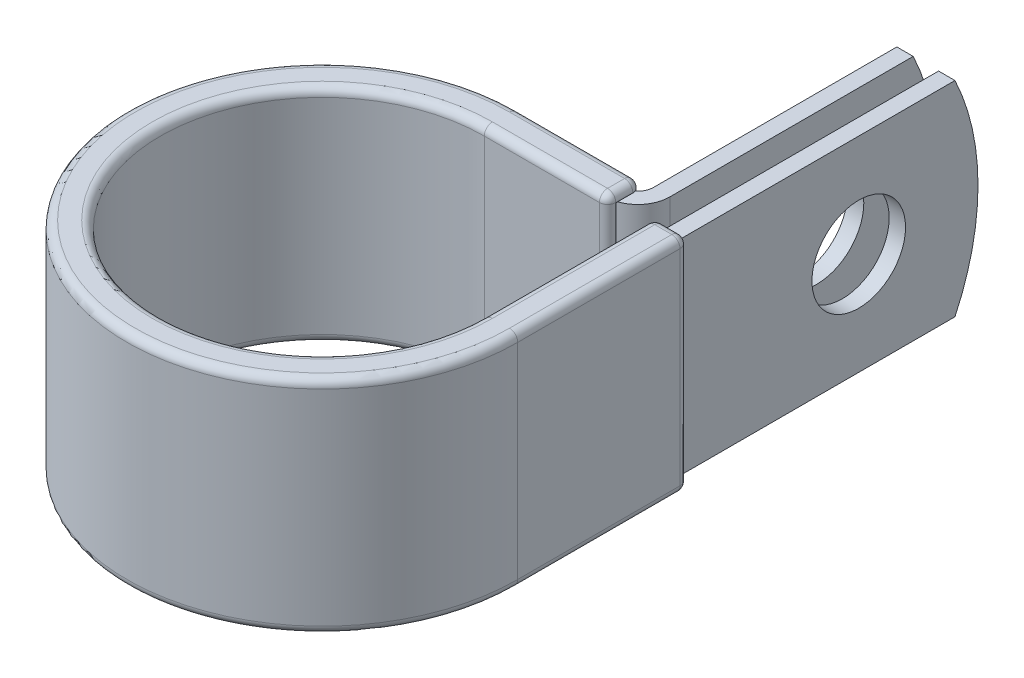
ISO-10303-21;
HEADER;
FILE_DESCRIPTION(('STEP AP214'),'2;1');
FILE_NAME('part.step','',(''),(''),'','','');
FILE_SCHEMA(('AUTOMOTIVE_DESIGN { 1 0 10303 214 1 1 1 1 }'));
ENDSEC;
DATA;
#1=APPLICATION_CONTEXT('core data for automotive mechanical design processes');
#2=APPLICATION_PROTOCOL_DEFINITION('international standard','automotive_design',2000,#1);
#3=PRODUCT_CONTEXT('',#1,'mechanical');
#4=PRODUCT('Part','Part','',(#3));
#5=PRODUCT_RELATED_PRODUCT_CATEGORY('part','',(#4));
#6=PRODUCT_DEFINITION_FORMATION('','',#4);
#7=PRODUCT_DEFINITION_CONTEXT('part definition',#1,'design');
#8=PRODUCT_DEFINITION('design','',#6,#7);
#9=PRODUCT_DEFINITION_SHAPE('','',#8);
#10=(LENGTH_UNIT() NAMED_UNIT(*) SI_UNIT(.MILLI.,.METRE.));
#11=(NAMED_UNIT(*) PLANE_ANGLE_UNIT() SI_UNIT($,.RADIAN.));
#12=(NAMED_UNIT(*) SI_UNIT($,.STERADIAN.) SOLID_ANGLE_UNIT());
#13=UNCERTAINTY_MEASURE_WITH_UNIT(LENGTH_MEASURE(1.E-05),#10,'distance_accuracy_value','');
#14=(GEOMETRIC_REPRESENTATION_CONTEXT(3) GLOBAL_UNCERTAINTY_ASSIGNED_CONTEXT((#13)) GLOBAL_UNIT_ASSIGNED_CONTEXT((#10,
#11,#12)) REPRESENTATION_CONTEXT('',''));
#15=CARTESIAN_POINT('',(0.,0.,0.));
#16=DIRECTION('',(0.,0.,1.));
#17=DIRECTION('',(1.,0.,0.));
#18=AXIS2_PLACEMENT_3D('',#15,#16,#17);
#19=CARTESIAN_POINT('',(13.50645,9.525,-43.6372));
#20=DIRECTION('',(1.,0.,0.));
#21=DIRECTION('',(0.,0.,-1.));
#22=AXIS2_PLACEMENT_3D('',#19,#20,#21);
#23=PLANE('',#22);
#24=CARTESIAN_POINT('',(13.50645,0.,-32.5374));
#25=DIRECTION('',(1.,0.,0.));
#26=DIRECTION('',(0.,0.,-1.));
#27=AXIS2_PLACEMENT_3D('',#24,#25,#26);
#28=CIRCLE('',#27,4.3561);
#29=CARTESIAN_POINT('',(13.50645,0.,-36.8935));
#30=VERTEX_POINT('',#29);
#31=EDGE_CURVE('E410',#30,#30,#28,.F.);
#32=ORIENTED_EDGE('',*,*,#31,.T.);
#33=EDGE_LOOP('',(#32));
#34=FACE_BOUND('',#33,.T.);
#35=DIRECTION('',(0.,0.,1.));
#36=VECTOR('',#35,1.);
#37=CARTESIAN_POINT('',(13.50645,-9.525,-43.6372));
#38=LINE('',#37,#36);
#39=CARTESIAN_POINT('',(13.50645,-9.525,-41.4926631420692));
#40=VERTEX_POINT('',#39);
#41=CARTESIAN_POINT('',(13.50645,-9.525,-18.84045));
#42=VERTEX_POINT('',#41);
#43=EDGE_CURVE('E432',#40,#42,#38,.T.);
#44=ORIENTED_EDGE('',*,*,#43,.F.);
#45=CARTESIAN_POINT('',(13.50645,0.,-21.4122));
#46=DIRECTION('',(1.,0.,0.));
#47=DIRECTION('',(0.,0.,-1.));
#48=AXIS2_PLACEMENT_3D('',#45,#46,#47);
#49=CIRCLE('',#48,22.225);
#50=CARTESIAN_POINT('',(13.50645,9.525,-41.4926631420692));
#51=VERTEX_POINT('',#50);
#52=EDGE_CURVE('E395',#40,#51,#49,.T.);
#53=ORIENTED_EDGE('',*,*,#52,.T.);
#54=DIRECTION('',(0.,0.,1.));
#55=VECTOR('',#54,1.);
#56=CARTESIAN_POINT('',(13.50645,9.525,-43.6372));
#57=LINE('',#56,#55);
#58=CARTESIAN_POINT('',(13.50645,9.525,-18.84045));
#59=VERTEX_POINT('',#58);
#60=EDGE_CURVE('E422',#51,#59,#57,.T.);
#61=ORIENTED_EDGE('',*,*,#60,.T.);
#62=DIRECTION('',(0.,-1.,0.));
#63=VECTOR('',#62,1.);
#64=CARTESIAN_POINT('',(13.50645,9.525,-18.84045));
#65=LINE('',#64,#63);
#66=EDGE_CURVE('E439',#59,#42,#65,.T.);
#67=ORIENTED_EDGE('',*,*,#66,.T.);
#68=EDGE_LOOP('',(#44,#53,#61,#67));
#69=FACE_BOUND('',#68,.T.);
#70=ADVANCED_FACE('F54',(#34,#69),#23,.T.);
#71=CARTESIAN_POINT('',(11.98245,9.525,-43.6372));
#72=DIRECTION('',(1.,0.,0.));
#73=DIRECTION('',(0.,0.,-1.));
#74=AXIS2_PLACEMENT_3D('',#71,#72,#73);
#75=PLANE('',#74);
#76=CARTESIAN_POINT('',(11.98245,0.,-32.5374));
#77=DIRECTION('',(-1.,0.,0.));
#78=DIRECTION('',(0.,0.,1.));
#79=AXIS2_PLACEMENT_3D('',#76,#77,#78);
#80=CIRCLE('',#79,4.3561);
#81=CARTESIAN_POINT('',(11.98245,0.,-28.1813));
#82=VERTEX_POINT('',#81);
#83=EDGE_CURVE('E407',#82,#82,#80,.T.);
#84=ORIENTED_EDGE('',*,*,#83,.F.);
#85=EDGE_LOOP('',(#84));
#86=FACE_BOUND('',#85,.T.);
#87=CARTESIAN_POINT('',(11.98245,0.,-21.4122));
#88=DIRECTION('',(-1.,0.,0.));
#89=DIRECTION('',(0.,0.,1.));
#90=AXIS2_PLACEMENT_3D('',#87,#88,#89);
#91=CIRCLE('',#90,22.225);
#92=CARTESIAN_POINT('',(11.98245,9.525,-41.4926631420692));
#93=VERTEX_POINT('',#92);
#94=CARTESIAN_POINT('',(11.98245,-9.525,-41.4926631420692));
#95=VERTEX_POINT('',#94);
#96=EDGE_CURVE('E387',#93,#95,#91,.T.);
#97=ORIENTED_EDGE('',*,*,#96,.T.);
#98=DIRECTION('',(0.,0.,1.));
#99=VECTOR('',#98,1.);
#100=CARTESIAN_POINT('',(11.98245,-9.525,-43.6372));
#101=LINE('',#100,#99);
#102=CARTESIAN_POINT('',(11.98245,-9.525,-18.84045));
#103=VERTEX_POINT('',#102);
#104=EDGE_CURVE('E434',#95,#103,#101,.T.);
#105=ORIENTED_EDGE('',*,*,#104,.T.);
#106=DIRECTION('',(0.,-1.,0.));
#107=VECTOR('',#106,1.);
#108=CARTESIAN_POINT('',(11.98245,9.525,-18.84045));
#109=LINE('',#108,#107);
#110=CARTESIAN_POINT('',(11.98245,9.525,-18.84045));
#111=VERTEX_POINT('',#110);
#112=EDGE_CURVE('E427',#111,#103,#109,.T.);
#113=ORIENTED_EDGE('',*,*,#112,.F.);
#114=DIRECTION('',(0.,0.,1.));
#115=VECTOR('',#114,1.);
#116=CARTESIAN_POINT('',(11.98245,9.525,-43.6372));
#117=LINE('',#116,#115);
#118=EDGE_CURVE('E424',#93,#111,#117,.T.);
#119=ORIENTED_EDGE('',*,*,#118,.F.);
#120=EDGE_LOOP('',(#97,#105,#113,#119));
#121=FACE_BOUND('',#120,.T.);
#122=ADVANCED_FACE('F738',(#86,#121),#75,.F.);
#123=CARTESIAN_POINT('',(0.,-9.525,0.));
#124=DIRECTION('',(0.,1.,0.));
#125=DIRECTION('',(1.,0.,0.));
#126=AXIS2_PLACEMENT_3D('',#123,#124,#125);
#127=PLANE('',#126);
#128=CARTESIAN_POINT('',(10.53465,-9.525,-18.84045));
#129=DIRECTION('',(0.,-1.,0.));
#130=DIRECTION('',(0.,0.,1.));
#131=AXIS2_PLACEMENT_3D('',#128,#129,#130);
#132=CIRCLE('',#131,2.9718);
#133=CARTESIAN_POINT('',(11.4744500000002,-9.525,-16.0211644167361));
#134=VERTEX_POINT('',#133);
#135=EDGE_CURVE('E429',#42,#134,#132,.T.);
#136=ORIENTED_EDGE('',*,*,#135,.T.);
#137=DIRECTION('',(0.,0.,-1.));
#138=VECTOR('',#137,1.);
#139=CARTESIAN_POINT('',(11.4744500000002,-9.525,-17.39265));
#140=LINE('',#139,#138);
#141=CARTESIAN_POINT('',(11.4744500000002,-9.525,-17.4244));
#142=VERTEX_POINT('',#141);
#143=EDGE_CURVE('E344',#134,#142,#140,.T.);
#144=ORIENTED_EDGE('',*,*,#143,.T.);
#145=CARTESIAN_POINT('',(10.7124500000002,-9.525,-17.4244));
#146=DIRECTION('',(0.,1.,0.));
#147=DIRECTION('',(0.,0.,1.));
#148=AXIS2_PLACEMENT_3D('',#145,#146,#147);
#149=CIRCLE('',#148,0.762);
#150=CARTESIAN_POINT('',(11.4237192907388,-9.525,-17.6977861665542));
#151=VERTEX_POINT('',#150);
#152=EDGE_CURVE('E504',#142,#151,#149,.T.);
#153=ORIENTED_EDGE('',*,*,#152,.T.);
#154=CARTESIAN_POINT('',(10.53465,-9.525,-18.84045));
#155=DIRECTION('',(0.,1.,0.));
#156=DIRECTION('',(1.,0.,0.));
#157=AXIS2_PLACEMENT_3D('',#154,#155,#156);
#158=CIRCLE('',#157,1.4478);
#159=EDGE_CURVE('E77',#103,#151,#158,.F.);
#160=ORIENTED_EDGE('',*,*,#159,.F.);
#161=ORIENTED_EDGE('',*,*,#104,.F.);
#162=DIRECTION('',(-1.,0.,0.));
#163=VECTOR('',#162,1.);
#164=CARTESIAN_POINT('',(17.39265,-9.525,-41.4926631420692));
#165=LINE('',#164,#163);
#166=EDGE_CURVE('E448',#40,#95,#165,.T.);
#167=ORIENTED_EDGE('',*,*,#166,.F.);
#168=ORIENTED_EDGE('',*,*,#43,.T.);
#169=EDGE_LOOP('',(#136,#144,#153,#160,#161,#167,#168));
#170=FACE_BOUND('',#169,.T.);
#171=ADVANCED_FACE('F744',(#170),#127,.F.);
#172=CARTESIAN_POINT('',(0.,9.525,0.));
#173=DIRECTION('',(0.,1.,0.));
#174=DIRECTION('',(1.,0.,0.));
#175=AXIS2_PLACEMENT_3D('',#172,#173,#174);
#176=PLANE('',#175);
#177=DIRECTION('',(0.,0.,-1.));
#178=VECTOR('',#177,1.);
#179=CARTESIAN_POINT('',(11.47445,9.525,1.60953919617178E-13));
#180=LINE('',#179,#178);
#181=CARTESIAN_POINT('',(11.4744500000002,9.525,-16.0211644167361));
#182=VERTEX_POINT('',#181);
#183=CARTESIAN_POINT('',(11.4744500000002,9.525,-17.4244));
#184=VERTEX_POINT('',#183);
#185=EDGE_CURVE('E381',#182,#184,#180,.T.);
#186=ORIENTED_EDGE('',*,*,#185,.F.);
#187=CARTESIAN_POINT('',(10.53465,9.525,-18.84045));
#188=DIRECTION('',(0.,-1.,0.));
#189=DIRECTION('',(0.,0.,1.));
#190=AXIS2_PLACEMENT_3D('',#187,#188,#189);
#191=CIRCLE('',#190,2.9718);
#192=EDGE_CURVE('E419',#59,#182,#191,.T.);
#193=ORIENTED_EDGE('',*,*,#192,.F.);
#194=ORIENTED_EDGE('',*,*,#60,.F.);
#195=DIRECTION('',(-1.,0.,0.));
#196=VECTOR('',#195,1.);
#197=CARTESIAN_POINT('',(17.39265,9.525,-41.4926631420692));
#198=LINE('',#197,#196);
#199=EDGE_CURVE('E445',#51,#93,#198,.T.);
#200=ORIENTED_EDGE('',*,*,#199,.T.);
#201=ORIENTED_EDGE('',*,*,#118,.T.);
#202=CARTESIAN_POINT('',(10.53465,9.525,-18.84045));
#203=DIRECTION('',(0.,1.,0.));
#204=DIRECTION('',(1.,0.,0.));
#205=AXIS2_PLACEMENT_3D('',#202,#203,#204);
#206=CIRCLE('',#205,1.4478);
#207=CARTESIAN_POINT('',(11.4237192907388,9.525,-17.6977861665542));
#208=VERTEX_POINT('',#207);
#209=EDGE_CURVE('E70',#111,#208,#206,.F.);
#210=ORIENTED_EDGE('',*,*,#209,.T.);
#211=CARTESIAN_POINT('',(10.7124500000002,9.525,-17.4244));
#212=DIRECTION('',(0.,1.,0.));
#213=DIRECTION('',(0.,0.,1.));
#214=AXIS2_PLACEMENT_3D('',#211,#212,#213);
#215=CIRCLE('',#214,0.762);
#216=EDGE_CURVE('E12',#208,#184,#215,.F.);
#217=ORIENTED_EDGE('',*,*,#216,.T.);
#218=EDGE_LOOP('',(#186,#193,#194,#200,#201,#210,#217));
#219=FACE_BOUND('',#218,.T.);
#220=ADVANCED_FACE('F752',(#219),#176,.T.);
#221=CARTESIAN_POINT('',(10.53465,9.525,-18.84045));
#222=DIRECTION('',(0.,-1.,0.));
#223=DIRECTION('',(0.,0.,-1.));
#224=AXIS2_PLACEMENT_3D('',#221,#222,#223);
#225=CYLINDRICAL_SURFACE('',#224,2.9718);
#226=ORIENTED_EDGE('',*,*,#135,.F.);
#227=ORIENTED_EDGE('',*,*,#66,.F.);
#228=ORIENTED_EDGE('',*,*,#192,.T.);
#229=CARTESIAN_POINT('',(10.53465,9.525,-18.84045));
#230=DIRECTION('',(0.,-1.,0.));
#231=DIRECTION('',(0.,0.,-1.));
#232=AXIS2_PLACEMENT_3D('',#229,#230,#231);
#233=CIRCLE('',#232,2.9718);
#234=CARTESIAN_POINT('',(10.53465,9.525,-15.86865));
#235=VERTEX_POINT('',#234);
#236=EDGE_CURVE('E378',#235,#182,#233,.F.);
#237=ORIENTED_EDGE('',*,*,#236,.F.);
#238=DIRECTION('',(0.,-1.,0.));
#239=VECTOR('',#238,1.);
#240=CARTESIAN_POINT('',(10.53465,9.525,-15.86865));
#241=LINE('',#240,#239);
#242=CARTESIAN_POINT('',(10.53465,-9.525,-15.86865));
#243=VERTEX_POINT('',#242);
#244=EDGE_CURVE('E442',#235,#243,#241,.T.);
#245=ORIENTED_EDGE('',*,*,#244,.T.);
#246=CARTESIAN_POINT('',(10.53465,-9.525,-18.84045));
#247=DIRECTION('',(0.,1.,0.));
#248=DIRECTION('',(0.,0.,1.));
#249=AXIS2_PLACEMENT_3D('',#246,#247,#248);
#250=CIRCLE('',#249,2.9718);
#251=EDGE_CURVE('E376',#134,#243,#250,.F.);
#252=ORIENTED_EDGE('',*,*,#251,.F.);
#253=EDGE_LOOP('',(#226,#227,#228,#237,#245,#252));
#254=FACE_BOUND('',#253,.T.);
#255=ADVANCED_FACE('F749',(#254),#225,.T.);
#256=CARTESIAN_POINT('',(10.53465,9.525,-18.84045));
#257=DIRECTION('',(0.,-1.,0.));
#258=DIRECTION('',(0.,0.,-1.));
#259=AXIS2_PLACEMENT_3D('',#256,#257,#258);
#260=CYLINDRICAL_SURFACE('',#259,1.4478);
#261=ORIENTED_EDGE('',*,*,#159,.T.);
#262=DIRECTION('',(0.,1.,0.));
#263=VECTOR('',#262,1.);
#264=CARTESIAN_POINT('',(11.423719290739,-9.525,-17.697786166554));
#265=LINE('',#264,#263);
#266=EDGE_CURVE('E63',#151,#208,#265,.T.);
#267=ORIENTED_EDGE('',*,*,#266,.T.);
#268=ORIENTED_EDGE('',*,*,#209,.F.);
#269=ORIENTED_EDGE('',*,*,#112,.T.);
#270=EDGE_LOOP('',(#261,#267,#268,#269));
#271=FACE_BOUND('',#270,.T.);
#272=ADVANCED_FACE('F751',(#271),#260,.F.);
#273=CARTESIAN_POINT('',(25.8273613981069,0.,-32.5374));
#274=DIRECTION('',(-1.,0.,0.));
#275=DIRECTION('',(0.,0.,1.));
#276=AXIS2_PLACEMENT_3D('',#273,#274,#275);
#277=CYLINDRICAL_SURFACE('',#276,4.3561);
#278=ORIENTED_EDGE('',*,*,#83,.T.);
#279=EDGE_LOOP('',(#278));
#280=FACE_BOUND('',#279,.T.);
#281=ORIENTED_EDGE('',*,*,#31,.F.);
#282=EDGE_LOOP('',(#281));
#283=FACE_BOUND('',#282,.T.);
#284=ADVANCED_FACE('F758',(#280,#283),#277,.F.);
#285=CARTESIAN_POINT('',(17.39265,0.,-21.4122));
#286=DIRECTION('',(-1.,0.,0.));
#287=DIRECTION('',(0.,0.,1.));
#288=AXIS2_PLACEMENT_3D('',#285,#286,#287);
#289=CYLINDRICAL_SURFACE('',#288,22.225);
#290=ORIENTED_EDGE('',*,*,#52,.F.);
#291=ORIENTED_EDGE('',*,*,#166,.T.);
#292=ORIENTED_EDGE('',*,*,#96,.F.);
#293=ORIENTED_EDGE('',*,*,#199,.F.);
#294=EDGE_LOOP('',(#290,#291,#292,#293));
#295=FACE_BOUND('',#294,.T.);
#296=ADVANCED_FACE('F809',(#295),#289,.T.);
#297=CARTESIAN_POINT('',(2.29530949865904E-13,-9.525,-15.86865));
#298=DIRECTION('',(0.,0.,1.));
#299=DIRECTION('',(1.,0.,0.));
#300=AXIS2_PLACEMENT_3D('',#297,#298,#299);
#301=PLANE('',#300);
#302=DIRECTION('',(1.,0.,0.));
#303=VECTOR('',#302,1.);
#304=CARTESIAN_POINT('',(2.29530949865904E-13,-9.525,-15.86865));
#305=LINE('',#304,#303);
#306=CARTESIAN_POINT('',(11.4744500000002,-9.525,-15.86865));
#307=VERTEX_POINT('',#306);
#308=EDGE_CURVE('E351',#243,#307,#305,.T.);
#309=ORIENTED_EDGE('',*,*,#308,.F.);
#310=ORIENTED_EDGE('',*,*,#244,.F.);
#311=DIRECTION('',(1.,0.,0.));
#312=VECTOR('',#311,1.);
#313=CARTESIAN_POINT('',(2.29530949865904E-13,9.525,-15.86865));
#314=LINE('',#313,#312);
#315=CARTESIAN_POINT('',(11.4744500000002,9.525,-15.86865));
#316=VERTEX_POINT('',#315);
#317=EDGE_CURVE('E353',#235,#316,#314,.T.);
#318=ORIENTED_EDGE('',*,*,#317,.T.);
#319=DIRECTION('',(0.,-1.,0.));
#320=VECTOR('',#319,1.);
#321=CARTESIAN_POINT('',(11.4744500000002,-9.525,-15.86865));
#322=LINE('',#321,#320);
#323=EDGE_CURVE('E283',#316,#307,#322,.T.);
#324=ORIENTED_EDGE('',*,*,#323,.T.);
#325=EDGE_LOOP('',(#309,#310,#318,#324));
#326=FACE_BOUND('',#325,.T.);
#327=ADVANCED_FACE('F781',(#326),#301,.F.);
#328=CARTESIAN_POINT('',(11.4744500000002,-9.55675,-15.8369));
#329=DIRECTION('',(1.,0.,0.));
#330=DIRECTION('',(0.,0.,-1.));
#331=AXIS2_PLACEMENT_3D('',#328,#329,#330);
#332=PLANE('',#331);
#333=DIRECTION('',(0.,0.,-1.));
#334=VECTOR('',#333,1.);
#335=CARTESIAN_POINT('',(11.4744500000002,-9.55675,-17.4244));
#336=LINE('',#335,#334);
#337=CARTESIAN_POINT('',(11.4744500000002,-9.55675,-15.8369));
#338=VERTEX_POINT('',#337);
#339=CARTESIAN_POINT('',(11.4744500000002,-9.55675,-17.4244));
#340=VERTEX_POINT('',#339);
#341=EDGE_CURVE('E458',#338,#340,#336,.T.);
#342=ORIENTED_EDGE('',*,*,#341,.T.);
#343=DIRECTION('',(0.,1.,0.));
#344=VECTOR('',#343,1.);
#345=CARTESIAN_POINT('',(11.4744500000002,-9.55675,-17.4244));
#346=LINE('',#345,#344);
#347=EDGE_CURVE('E462',#340,#142,#346,.T.);
#348=ORIENTED_EDGE('',*,*,#347,.T.);
#349=ORIENTED_EDGE('',*,*,#143,.F.);
#350=EDGE_CURVE('E345',#307,#134,#140,.T.);
#351=ORIENTED_EDGE('',*,*,#350,.F.);
#352=ORIENTED_EDGE('',*,*,#323,.F.);
#353=DIRECTION('',(0.,0.,1.));
#354=VECTOR('',#353,1.);
#355=CARTESIAN_POINT('',(11.4744500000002,9.525,-15.86865));
#356=LINE('',#355,#354);
#357=EDGE_CURVE('E348',#182,#316,#356,.T.);
#358=ORIENTED_EDGE('',*,*,#357,.F.);
#359=ORIENTED_EDGE('',*,*,#185,.T.);
#360=DIRECTION('',(0.,1.,0.));
#361=VECTOR('',#360,1.);
#362=CARTESIAN_POINT('',(11.4744500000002,-9.55675,-17.4244));
#363=LINE('',#362,#361);
#364=CARTESIAN_POINT('',(11.4744500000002,9.55674999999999,-17.4244));
#365=VERTEX_POINT('',#364);
#366=EDGE_CURVE('E460',#184,#365,#363,.T.);
#367=ORIENTED_EDGE('',*,*,#366,.T.);
#368=DIRECTION('',(0.,0.,1.));
#369=VECTOR('',#368,1.);
#370=CARTESIAN_POINT('',(11.4744500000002,9.55674999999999,-15.8369));
#371=LINE('',#370,#369);
#372=CARTESIAN_POINT('',(11.4744500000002,9.55674999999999,-15.8369));
#373=VERTEX_POINT('',#372);
#374=EDGE_CURVE('E454',#365,#373,#371,.T.);
#375=ORIENTED_EDGE('',*,*,#374,.T.);
#376=DIRECTION('',(0.,-1.,0.));
#377=VECTOR('',#376,1.);
#378=CARTESIAN_POINT('',(11.4744500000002,-9.55675,-15.8369));
#379=LINE('',#378,#377);
#380=EDGE_CURVE('E456',#373,#338,#379,.T.);
#381=ORIENTED_EDGE('',*,*,#380,.T.);
#382=EDGE_LOOP('',(#342,#348,#349,#351,#352,#358,#359,#367,#375,#381));
#383=FACE_BOUND('',#382,.T.);
#384=ADVANCED_FACE('F777',(#383),#332,.T.);
#385=CARTESIAN_POINT('',(2.51353700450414E-13,-9.55675,-17.4244));
#386=DIRECTION('',(1.,0.,0.));
#387=DIRECTION('',(0.,0.,-1.));
#388=AXIS2_PLACEMENT_3D('',#385,#386,#387);
#389=CYLINDRICAL_SURFACE('',#388,0.762000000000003);
#390=DIRECTION('',(1.,0.,0.));
#391=VECTOR('',#390,1.);
#392=CARTESIAN_POINT('',(2.62042394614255E-13,-9.55675,-18.1864));
#393=LINE('',#392,#391);
#394=CARTESIAN_POINT('',(2.62042394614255E-13,-9.55675,-18.1864));
#395=VERTEX_POINT('',#394);
#396=CARTESIAN_POINT('',(10.7124500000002,-9.55675,-18.1864));
#397=VERTEX_POINT('',#396);
#398=EDGE_CURVE('E370',#395,#397,#393,.T.);
#399=ORIENTED_EDGE('',*,*,#398,.T.);
#400=CARTESIAN_POINT('',(10.7124500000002,-9.55675,-17.4244));
#401=DIRECTION('',(1.,0.,0.));
#402=DIRECTION('',(0.,0.,-1.));
#403=AXIS2_PLACEMENT_3D('',#400,#401,#402);
#404=CIRCLE('',#403,0.762000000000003);
#405=CARTESIAN_POINT('',(10.7124500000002,-10.31875,-17.4244));
#406=VERTEX_POINT('',#405);
#407=EDGE_CURVE('E467',#397,#406,#404,.F.);
#408=ORIENTED_EDGE('',*,*,#407,.T.);
#409=DIRECTION('',(1.,0.,0.));
#410=VECTOR('',#409,1.);
#411=CARTESIAN_POINT('',(2.51353700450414E-13,-10.31875,-17.4244));
#412=LINE('',#411,#410);
#413=CARTESIAN_POINT('',(2.51353700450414E-13,-10.31875,-17.4244));
#414=VERTEX_POINT('',#413);
#415=EDGE_CURVE('E373',#414,#406,#412,.T.);
#416=ORIENTED_EDGE('',*,*,#415,.F.);
#417=CARTESIAN_POINT('',(2.51353700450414E-13,-9.55675,-17.4244));
#418=DIRECTION('',(1.,0.,0.));
#419=DIRECTION('',(0.,0.,1.));
#420=AXIS2_PLACEMENT_3D('',#417,#418,#419);
#421=CIRCLE('',#420,0.762000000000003);
#422=EDGE_CURVE('E321',#414,#395,#421,.T.);
#423=ORIENTED_EDGE('',*,*,#422,.T.);
#424=EDGE_LOOP('',(#399,#408,#416,#423));
#425=FACE_BOUND('',#424,.T.);
#426=ADVANCED_FACE('F620',(#425),#389,.T.);
#427=CARTESIAN_POINT('',(2.62042394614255E-13,9.55675,-18.1864));
#428=DIRECTION('',(0.,0.,-1.));
#429=DIRECTION('',(0.,1.,0.));
#430=AXIS2_PLACEMENT_3D('',#427,#428,#429);
#431=PLANE('',#430);
#432=DIRECTION('',(1.,0.,0.));
#433=VECTOR('',#432,1.);
#434=CARTESIAN_POINT('',(2.62042394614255E-13,9.55675,-18.1864));
#435=LINE('',#434,#433);
#436=CARTESIAN_POINT('',(2.62042394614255E-13,9.55675,-18.1864));
#437=VERTEX_POINT('',#436);
#438=CARTESIAN_POINT('',(10.7124500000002,9.55675,-18.1864));
#439=VERTEX_POINT('',#438);
#440=EDGE_CURVE('E367',#437,#439,#435,.T.);
#441=ORIENTED_EDGE('',*,*,#440,.T.);
#442=DIRECTION('',(0.,1.,0.));
#443=VECTOR('',#442,1.);
#444=CARTESIAN_POINT('',(10.7124500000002,9.55675,-18.1864));
#445=LINE('',#444,#443);
#446=EDGE_CURVE('E465',#439,#397,#445,.F.);
#447=ORIENTED_EDGE('',*,*,#446,.T.);
#448=ORIENTED_EDGE('',*,*,#398,.F.);
#449=DIRECTION('',(0.,1.,0.));
#450=VECTOR('',#449,1.);
#451=CARTESIAN_POINT('',(2.62042394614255E-13,9.55675,-18.1864));
#452=LINE('',#451,#450);
#453=EDGE_CURVE('E318',#395,#437,#452,.T.);
#454=ORIENTED_EDGE('',*,*,#453,.T.);
#455=EDGE_LOOP('',(#441,#447,#448,#454));
#456=FACE_BOUND('',#455,.T.);
#457=ADVANCED_FACE('F626',(#456),#431,.T.);
#458=CARTESIAN_POINT('',(2.51353700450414E-13,9.55675,-17.4244));
#459=DIRECTION('',(1.,0.,0.));
#460=DIRECTION('',(0.,0.,-1.));
#461=AXIS2_PLACEMENT_3D('',#458,#459,#460);
#462=CYLINDRICAL_SURFACE('',#461,0.762000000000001);
#463=DIRECTION('',(1.,0.,0.));
#464=VECTOR('',#463,1.);
#465=CARTESIAN_POINT('',(2.51353700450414E-13,10.31875,-17.4244));
#466=LINE('',#465,#464);
#467=CARTESIAN_POINT('',(2.51353700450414E-13,10.31875,-17.4244));
#468=VERTEX_POINT('',#467);
#469=CARTESIAN_POINT('',(10.7124500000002,10.31875,-17.4244));
#470=VERTEX_POINT('',#469);
#471=EDGE_CURVE('E364',#468,#470,#466,.T.);
#472=ORIENTED_EDGE('',*,*,#471,.T.);
#473=CARTESIAN_POINT('',(10.7124500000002,9.55675,-17.4244));
#474=DIRECTION('',(1.,0.,0.));
#475=DIRECTION('',(0.,0.,-1.));
#476=AXIS2_PLACEMENT_3D('',#473,#474,#475);
#477=CIRCLE('',#476,0.762000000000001);
#478=EDGE_CURVE('E451',#470,#439,#477,.F.);
#479=ORIENTED_EDGE('',*,*,#478,.T.);
#480=ORIENTED_EDGE('',*,*,#440,.F.);
#481=CARTESIAN_POINT('',(2.51353700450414E-13,9.55675,-17.4244));
#482=DIRECTION('',(1.,0.,0.));
#483=DIRECTION('',(0.,0.,1.));
#484=AXIS2_PLACEMENT_3D('',#481,#482,#483);
#485=CIRCLE('',#484,0.762000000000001);
#486=EDGE_CURVE('E315',#437,#468,#485,.T.);
#487=ORIENTED_EDGE('',*,*,#486,.T.);
#488=EDGE_LOOP('',(#472,#479,#480,#487));
#489=FACE_BOUND('',#488,.T.);
#490=ADVANCED_FACE('F630',(#489),#462,.T.);
#491=CARTESIAN_POINT('',(2.29085587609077E-13,9.55675,-15.8369));
#492=DIRECTION('',(1.,0.,0.));
#493=DIRECTION('',(0.,0.,-1.));
#494=AXIS2_PLACEMENT_3D('',#491,#492,#493);
#495=CYLINDRICAL_SURFACE('',#494,0.762000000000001);
#496=DIRECTION('',(1.,0.,0.));
#497=VECTOR('',#496,1.);
#498=CARTESIAN_POINT('',(2.18396893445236E-13,9.55675,-15.0749));
#499=LINE('',#498,#497);
#500=CARTESIAN_POINT('',(2.18396893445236E-13,9.55675,-15.0749));
#501=VERTEX_POINT('',#500);
#502=CARTESIAN_POINT('',(10.7124500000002,9.55675,-15.0749));
#503=VERTEX_POINT('',#502);
#504=EDGE_CURVE('E358',#501,#503,#499,.T.);
#505=ORIENTED_EDGE('',*,*,#504,.T.);
#506=CARTESIAN_POINT('',(10.7124500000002,9.55675,-15.8369));
#507=DIRECTION('',(1.,0.,0.));
#508=DIRECTION('',(0.,0.,-1.));
#509=AXIS2_PLACEMENT_3D('',#506,#507,#508);
#510=CIRCLE('',#509,0.762000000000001);
#511=CARTESIAN_POINT('',(10.7124500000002,10.31875,-15.8369));
#512=VERTEX_POINT('',#511);
#513=EDGE_CURVE('E477',#503,#512,#510,.F.);
#514=ORIENTED_EDGE('',*,*,#513,.T.);
#515=DIRECTION('',(1.,0.,0.));
#516=VECTOR('',#515,1.);
#517=CARTESIAN_POINT('',(2.29085587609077E-13,10.31875,-15.8369));
#518=LINE('',#517,#516);
#519=CARTESIAN_POINT('',(2.29085587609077E-13,10.31875,-15.8369));
#520=VERTEX_POINT('',#519);
#521=EDGE_CURVE('E361',#520,#512,#518,.T.);
#522=ORIENTED_EDGE('',*,*,#521,.F.);
#523=CARTESIAN_POINT('',(2.29085587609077E-13,9.55675,-15.8369));
#524=DIRECTION('',(1.,0.,0.));
#525=DIRECTION('',(0.,0.,1.));
#526=AXIS2_PLACEMENT_3D('',#523,#524,#525);
#527=CIRCLE('',#526,0.762000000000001);
#528=EDGE_CURVE('E312',#520,#501,#527,.T.);
#529=ORIENTED_EDGE('',*,*,#528,.T.);
#530=EDGE_LOOP('',(#505,#514,#522,#529));
#531=FACE_BOUND('',#530,.T.);
#532=ADVANCED_FACE('F671',(#531),#495,.T.);
#533=CARTESIAN_POINT('',(2.18396893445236E-13,-9.55675,-15.0749));
#534=DIRECTION('',(0.,0.,1.));
#535=DIRECTION('',(1.,0.,0.));
#536=AXIS2_PLACEMENT_3D('',#533,#534,#535);
#537=PLANE('',#536);
#538=DIRECTION('',(1.,0.,0.));
#539=VECTOR('',#538,1.);
#540=CARTESIAN_POINT('',(2.18396893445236E-13,-9.55675,-15.0749));
#541=LINE('',#540,#539);
#542=CARTESIAN_POINT('',(2.18396893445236E-13,-9.55675,-15.0749));
#543=VERTEX_POINT('',#542);
#544=CARTESIAN_POINT('',(10.7124500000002,-9.55675,-15.0749));
#545=VERTEX_POINT('',#544);
#546=EDGE_CURVE('E355',#543,#545,#541,.T.);
#547=ORIENTED_EDGE('',*,*,#546,.T.);
#548=DIRECTION('',(0.,-1.,0.));
#549=VECTOR('',#548,1.);
#550=CARTESIAN_POINT('',(10.7124500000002,-9.55675,-15.0749));
#551=LINE('',#550,#549);
#552=EDGE_CURVE('E475',#545,#503,#551,.F.);
#553=ORIENTED_EDGE('',*,*,#552,.T.);
#554=ORIENTED_EDGE('',*,*,#504,.F.);
#555=DIRECTION('',(0.,-1.,0.));
#556=VECTOR('',#555,1.);
#557=CARTESIAN_POINT('',(2.18396893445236E-13,-9.55675,-15.0749));
#558=LINE('',#557,#556);
#559=EDGE_CURVE('E303',#501,#543,#558,.T.);
#560=ORIENTED_EDGE('',*,*,#559,.T.);
#561=EDGE_LOOP('',(#547,#553,#554,#560));
#562=FACE_BOUND('',#561,.T.);
#563=ADVANCED_FACE('F669',(#562),#537,.T.);
#564=CARTESIAN_POINT('',(2.29085587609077E-13,-9.55675,-15.8369));
#565=DIRECTION('',(1.,0.,0.));
#566=DIRECTION('',(0.,0.,-1.));
#567=AXIS2_PLACEMENT_3D('',#564,#565,#566);
#568=CYLINDRICAL_SURFACE('',#567,0.762);
#569=DIRECTION('',(1.,0.,0.));
#570=VECTOR('',#569,1.);
#571=CARTESIAN_POINT('',(2.29085587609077E-13,-10.31875,-15.8369));
#572=LINE('',#571,#570);
#573=CARTESIAN_POINT('',(2.29085587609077E-13,-10.31875,-15.8369));
#574=VERTEX_POINT('',#573);
#575=CARTESIAN_POINT('',(10.7124500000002,-10.31875,-15.8369));
#576=VERTEX_POINT('',#575);
#577=EDGE_CURVE('E279',#574,#576,#572,.T.);
#578=ORIENTED_EDGE('',*,*,#577,.T.);
#579=CARTESIAN_POINT('',(10.7124500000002,-9.55675,-15.8369));
#580=DIRECTION('',(1.,0.,0.));
#581=DIRECTION('',(0.,0.,-1.));
#582=AXIS2_PLACEMENT_3D('',#579,#580,#581);
#583=CIRCLE('',#582,0.762);
#584=EDGE_CURVE('E473',#576,#545,#583,.F.);
#585=ORIENTED_EDGE('',*,*,#584,.T.);
#586=ORIENTED_EDGE('',*,*,#546,.F.);
#587=CARTESIAN_POINT('',(2.29085587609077E-13,-9.55675,-15.8369));
#588=DIRECTION('',(1.,0.,0.));
#589=DIRECTION('',(0.,0.,-1.));
#590=AXIS2_PLACEMENT_3D('',#587,#588,#589);
#591=CIRCLE('',#590,0.762);
#592=EDGE_CURVE('E300',#543,#574,#591,.T.);
#593=ORIENTED_EDGE('',*,*,#592,.T.);
#594=EDGE_LOOP('',(#578,#585,#586,#593));
#595=FACE_BOUND('',#594,.T.);
#596=ADVANCED_FACE('F659',(#595),#568,.T.);
#597=CARTESIAN_POINT('',(0.,-9.55675,0.));
#598=DIRECTION('',(0.,-1.,0.));
#599=DIRECTION('',(0.,0.,-1.));
#600=AXIS2_PLACEMENT_3D('',#597,#598,#599);
#601=TOROIDAL_SURFACE('',#600,17.4244,0.762000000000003);
#602=CARTESIAN_POINT('',(17.4244,-9.55675,0.));
#603=DIRECTION('',(0.,0.,1.));
#604=DIRECTION('',(-1.,0.,0.));
#605=AXIS2_PLACEMENT_3D('',#602,#603,#604);
#606=CIRCLE('',#605,0.762000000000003);
#607=CARTESIAN_POINT('',(17.4244,-10.31875,0.));
#608=VERTEX_POINT('',#607);
#609=CARTESIAN_POINT('',(18.1864,-9.55675,0.));
#610=VERTEX_POINT('',#609);
#611=EDGE_CURVE('E294',#608,#610,#606,.T.);
#612=ORIENTED_EDGE('',*,*,#611,.T.);
#613=CARTESIAN_POINT('',(0.,-9.55675,0.));
#614=DIRECTION('',(0.,-1.,0.));
#615=DIRECTION('',(0.,0.,-1.));
#616=AXIS2_PLACEMENT_3D('',#613,#614,#615);
#617=CIRCLE('',#616,18.1864);
#618=EDGE_CURVE('E337',#610,#395,#617,.T.);
#619=ORIENTED_EDGE('',*,*,#618,.T.);
#620=ORIENTED_EDGE('',*,*,#422,.F.);
#621=CARTESIAN_POINT('',(0.,-10.31875,0.));
#622=DIRECTION('',(0.,-1.,0.));
#623=DIRECTION('',(0.,0.,-1.));
#624=AXIS2_PLACEMENT_3D('',#621,#622,#623);
#625=CIRCLE('',#624,17.4244);
#626=EDGE_CURVE('E284',#608,#414,#625,.T.);
#627=ORIENTED_EDGE('',*,*,#626,.F.);
#628=EDGE_LOOP('',(#612,#619,#620,#627));
#629=FACE_BOUND('',#628,.T.);
#630=ADVANCED_FACE('F617',(#629),#601,.T.);
#631=CARTESIAN_POINT('',(0.,9.525,0.));
#632=DIRECTION('',(0.,-1.,0.));
#633=DIRECTION('',(0.,0.,-1.));
#634=AXIS2_PLACEMENT_3D('',#631,#632,#633);
#635=CYLINDRICAL_SURFACE('',#634,18.1864);
#636=DIRECTION('',(0.,1.,0.));
#637=VECTOR('',#636,1.);
#638=CARTESIAN_POINT('',(18.1864,9.55675,0.));
#639=LINE('',#638,#637);
#640=CARTESIAN_POINT('',(18.1864,9.55675,0.));
#641=VERTEX_POINT('',#640);
#642=EDGE_CURVE('E605',#610,#641,#639,.T.);
#643=ORIENTED_EDGE('',*,*,#642,.T.);
#644=CARTESIAN_POINT('',(0.,9.55675,0.));
#645=DIRECTION('',(0.,-1.,0.));
#646=DIRECTION('',(0.,0.,-1.));
#647=AXIS2_PLACEMENT_3D('',#644,#645,#646);
#648=CIRCLE('',#647,18.1864);
#649=EDGE_CURVE('E334',#641,#437,#648,.T.);
#650=ORIENTED_EDGE('',*,*,#649,.T.);
#651=ORIENTED_EDGE('',*,*,#453,.F.);
#652=ORIENTED_EDGE('',*,*,#618,.F.);
#653=EDGE_LOOP('',(#643,#650,#651,#652));
#654=FACE_BOUND('',#653,.T.);
#655=ADVANCED_FACE('F623',(#654),#635,.T.);
#656=CARTESIAN_POINT('',(0.,9.55675,0.));
#657=DIRECTION('',(0.,-1.,0.));
#658=DIRECTION('',(0.,0.,-1.));
#659=AXIS2_PLACEMENT_3D('',#656,#657,#658);
#660=TOROIDAL_SURFACE('',#659,17.4244,0.762000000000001);
#661=CARTESIAN_POINT('',(17.4244,9.55675,0.));
#662=DIRECTION('',(0.,0.,1.));
#663=DIRECTION('',(-1.,0.,0.));
#664=AXIS2_PLACEMENT_3D('',#661,#662,#663);
#665=CIRCLE('',#664,0.762000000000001);
#666=CARTESIAN_POINT('',(17.4244,10.31875,0.));
#667=VERTEX_POINT('',#666);
#668=EDGE_CURVE('E684',#641,#667,#665,.T.);
#669=ORIENTED_EDGE('',*,*,#668,.T.);
#670=CARTESIAN_POINT('',(0.,10.31875,0.));
#671=DIRECTION('',(0.,-1.,0.));
#672=DIRECTION('',(0.,0.,-1.));
#673=AXIS2_PLACEMENT_3D('',#670,#671,#672);
#674=CIRCLE('',#673,17.4244);
#675=EDGE_CURVE('E331',#667,#468,#674,.T.);
#676=ORIENTED_EDGE('',*,*,#675,.T.);
#677=ORIENTED_EDGE('',*,*,#486,.F.);
#678=ORIENTED_EDGE('',*,*,#649,.F.);
#679=EDGE_LOOP('',(#669,#676,#677,#678));
#680=FACE_BOUND('',#679,.T.);
#681=ADVANCED_FACE('F628',(#680),#660,.T.);
#682=CARTESIAN_POINT('',(0.,9.55675,0.));
#683=DIRECTION('',(0.,-1.,0.));
#684=DIRECTION('',(0.,0.,-1.));
#685=AXIS2_PLACEMENT_3D('',#682,#683,#684);
#686=TOROIDAL_SURFACE('',#685,15.8369,0.762000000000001);
#687=CARTESIAN_POINT('',(15.8369,9.55675,0.));
#688=DIRECTION('',(0.,0.,1.));
#689=DIRECTION('',(-1.,0.,0.));
#690=AXIS2_PLACEMENT_3D('',#687,#688,#689);
#691=CIRCLE('',#690,0.762000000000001);
#692=CARTESIAN_POINT('',(15.8369,10.31875,0.));
#693=VERTEX_POINT('',#692);
#694=CARTESIAN_POINT('',(15.0749,9.55675,0.));
#695=VERTEX_POINT('',#694);
#696=EDGE_CURVE('E680',#693,#695,#691,.T.);
#697=ORIENTED_EDGE('',*,*,#696,.T.);
#698=CARTESIAN_POINT('',(0.,9.55675,0.));
#699=DIRECTION('',(0.,-1.,0.));
#700=DIRECTION('',(0.,0.,-1.));
#701=AXIS2_PLACEMENT_3D('',#698,#699,#700);
#702=CIRCLE('',#701,15.0749);
#703=EDGE_CURVE('E325',#695,#501,#702,.T.);
#704=ORIENTED_EDGE('',*,*,#703,.T.);
#705=ORIENTED_EDGE('',*,*,#528,.F.);
#706=CARTESIAN_POINT('',(0.,10.31875,0.));
#707=DIRECTION('',(0.,-1.,0.));
#708=DIRECTION('',(0.,0.,-1.));
#709=AXIS2_PLACEMENT_3D('',#706,#707,#708);
#710=CIRCLE('',#709,15.8369);
#711=EDGE_CURVE('E328',#693,#520,#710,.T.);
#712=ORIENTED_EDGE('',*,*,#711,.F.);
#713=EDGE_LOOP('',(#697,#704,#705,#712));
#714=FACE_BOUND('',#713,.T.);
#715=ADVANCED_FACE('F678',(#714),#686,.T.);
#716=CARTESIAN_POINT('',(0.,9.525,0.));
#717=DIRECTION('',(0.,-1.,0.));
#718=DIRECTION('',(0.,0.,-1.));
#719=AXIS2_PLACEMENT_3D('',#716,#717,#718);
#720=CYLINDRICAL_SURFACE('',#719,15.0749);
#721=DIRECTION('',(0.,-1.,0.));
#722=VECTOR('',#721,1.);
#723=CARTESIAN_POINT('',(15.0749,-9.55675,0.));
#724=LINE('',#723,#722);
#725=CARTESIAN_POINT('',(15.0749,-9.55675,0.));
#726=VERTEX_POINT('',#725);
#727=EDGE_CURVE('E683',#695,#726,#724,.T.);
#728=ORIENTED_EDGE('',*,*,#727,.T.);
#729=CARTESIAN_POINT('',(0.,-9.55675,0.));
#730=DIRECTION('',(0.,-1.,0.));
#731=DIRECTION('',(0.,0.,-1.));
#732=AXIS2_PLACEMENT_3D('',#729,#730,#731);
#733=CIRCLE('',#732,15.0749);
#734=EDGE_CURVE('E290',#726,#543,#733,.T.);
#735=ORIENTED_EDGE('',*,*,#734,.T.);
#736=ORIENTED_EDGE('',*,*,#559,.F.);
#737=ORIENTED_EDGE('',*,*,#703,.F.);
#738=EDGE_LOOP('',(#728,#735,#736,#737));
#739=FACE_BOUND('',#738,.T.);
#740=ADVANCED_FACE('F676',(#739),#720,.F.);
#741=CARTESIAN_POINT('',(0.,-9.55675,0.));
#742=DIRECTION('',(0.,-1.,0.));
#743=DIRECTION('',(0.,0.,-1.));
#744=AXIS2_PLACEMENT_3D('',#741,#742,#743);
#745=TOROIDAL_SURFACE('',#744,15.8369,0.762);
#746=CARTESIAN_POINT('',(15.8369,-9.55675,0.));
#747=DIRECTION('',(0.,0.,1.));
#748=DIRECTION('',(1.,0.,0.));
#749=AXIS2_PLACEMENT_3D('',#746,#747,#748);
#750=CIRCLE('',#749,0.762);
#751=CARTESIAN_POINT('',(15.8369,-10.31875,0.));
#752=VERTEX_POINT('',#751);
#753=EDGE_CURVE('E287',#726,#752,#750,.T.);
#754=ORIENTED_EDGE('',*,*,#753,.T.);
#755=CARTESIAN_POINT('',(0.,-10.31875,0.));
#756=DIRECTION('',(0.,-1.,0.));
#757=DIRECTION('',(0.,0.,-1.));
#758=AXIS2_PLACEMENT_3D('',#755,#756,#757);
#759=CIRCLE('',#758,15.8369);
#760=EDGE_CURVE('E271',#752,#574,#759,.T.);
#761=ORIENTED_EDGE('',*,*,#760,.T.);
#762=ORIENTED_EDGE('',*,*,#592,.F.);
#763=ORIENTED_EDGE('',*,*,#734,.F.);
#764=EDGE_LOOP('',(#754,#761,#762,#763));
#765=FACE_BOUND('',#764,.T.);
#766=ADVANCED_FACE('F288',(#765),#745,.T.);
#767=CARTESIAN_POINT('',(15.8369,-9.55675,0.));
#768=DIRECTION('',(0.,0.,-1.));
#769=DIRECTION('',(-1.,0.,0.));
#770=AXIS2_PLACEMENT_3D('',#767,#768,#769);
#771=CYLINDRICAL_SURFACE('',#770,0.762);
#772=DIRECTION('',(0.,0.,-1.));
#773=VECTOR('',#772,1.);
#774=CARTESIAN_POINT('',(15.0749,-9.55675,0.));
#775=LINE('',#774,#773);
#776=CARTESIAN_POINT('',(15.0749,-9.55675,-15.10665));
#777=VERTEX_POINT('',#776);
#778=EDGE_CURVE('E691',#726,#777,#775,.T.);
#779=ORIENTED_EDGE('',*,*,#778,.T.);
#780=CARTESIAN_POINT('',(15.8369,-9.55675,-15.10665));
#781=DIRECTION('',(0.,0.,-1.));
#782=DIRECTION('',(-1.,0.,0.));
#783=AXIS2_PLACEMENT_3D('',#780,#781,#782);
#784=CIRCLE('',#783,0.762);
#785=CARTESIAN_POINT('',(15.8369,-10.31875,-15.10665));
#786=VERTEX_POINT('',#785);
#787=EDGE_CURVE('E299',#777,#786,#784,.F.);
#788=ORIENTED_EDGE('',*,*,#787,.T.);
#789=DIRECTION('',(0.,0.,-1.));
#790=VECTOR('',#789,1.);
#791=CARTESIAN_POINT('',(15.8369,-10.31875,0.));
#792=LINE('',#791,#790);
#793=EDGE_CURVE('E276',#752,#786,#792,.T.);
#794=ORIENTED_EDGE('',*,*,#793,.F.);
#795=ORIENTED_EDGE('',*,*,#753,.F.);
#796=EDGE_LOOP('',(#779,#788,#794,#795));
#797=FACE_BOUND('',#796,.T.);
#798=ADVANCED_FACE('F297',(#797),#771,.T.);
#799=CARTESIAN_POINT('',(17.4244,-10.31875,0.));
#800=DIRECTION('',(0.,1.,0.));
#801=DIRECTION('',(0.,0.,1.));
#802=AXIS2_PLACEMENT_3D('',#799,#800,#801);
#803=PLANE('',#802);
#804=ORIENTED_EDGE('',*,*,#415,.T.);
#805=DIRECTION('',(0.,0.,-1.));
#806=VECTOR('',#805,1.);
#807=CARTESIAN_POINT('',(10.7124500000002,-10.31875,-15.8369));
#808=LINE('',#807,#806);
#809=EDGE_CURVE('E471',#406,#576,#808,.F.);
#810=ORIENTED_EDGE('',*,*,#809,.T.);
#811=ORIENTED_EDGE('',*,*,#577,.F.);
#812=ORIENTED_EDGE('',*,*,#760,.F.);
#813=ORIENTED_EDGE('',*,*,#793,.T.);
#814=DIRECTION('',(1.,0.,0.));
#815=VECTOR('',#814,1.);
#816=CARTESIAN_POINT('',(17.4244,-10.31875,-15.10665));
#817=LINE('',#816,#815);
#818=CARTESIAN_POINT('',(17.4244,-10.31875,-15.10665));
#819=VERTEX_POINT('',#818);
#820=EDGE_CURVE('E469',#786,#819,#817,.T.);
#821=ORIENTED_EDGE('',*,*,#820,.T.);
#822=DIRECTION('',(0.,0.,-1.));
#823=VECTOR('',#822,1.);
#824=CARTESIAN_POINT('',(17.4244,-10.31875,0.));
#825=LINE('',#824,#823);
#826=EDGE_CURVE('E301',#608,#819,#825,.T.);
#827=ORIENTED_EDGE('',*,*,#826,.F.);
#828=ORIENTED_EDGE('',*,*,#626,.T.);
#829=EDGE_LOOP('',(#804,#810,#811,#812,#813,#821,#827,#828));
#830=FACE_BOUND('',#829,.T.);
#831=ADVANCED_FACE('F274',(#830),#803,.F.);
#832=CARTESIAN_POINT('',(17.4244,-9.55675,0.));
#833=DIRECTION('',(0.,0.,-1.));
#834=DIRECTION('',(-1.,0.,0.));
#835=AXIS2_PLACEMENT_3D('',#832,#833,#834);
#836=CYLINDRICAL_SURFACE('',#835,0.762000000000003);
#837=ORIENTED_EDGE('',*,*,#826,.T.);
#838=CARTESIAN_POINT('',(17.4244,-9.55675,-15.10665));
#839=DIRECTION('',(0.,0.,-1.));
#840=DIRECTION('',(-1.,0.,0.));
#841=AXIS2_PLACEMENT_3D('',#838,#839,#840);
#842=CIRCLE('',#841,0.762000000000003);
#843=CARTESIAN_POINT('',(18.1864,-9.55675,-15.10665));
#844=VERTEX_POINT('',#843);
#845=EDGE_CURVE('E493',#819,#844,#842,.F.);
#846=ORIENTED_EDGE('',*,*,#845,.T.);
#847=DIRECTION('',(0.,0.,-1.));
#848=VECTOR('',#847,1.);
#849=CARTESIAN_POINT('',(18.1864,-9.55675,0.));
#850=LINE('',#849,#848);
#851=EDGE_CURVE('E306',#610,#844,#850,.T.);
#852=ORIENTED_EDGE('',*,*,#851,.F.);
#853=ORIENTED_EDGE('',*,*,#611,.F.);
#854=EDGE_LOOP('',(#837,#846,#852,#853));
#855=FACE_BOUND('',#854,.T.);
#856=ADVANCED_FACE('F611',(#855),#836,.T.);
#857=CARTESIAN_POINT('',(18.1864,9.55675,0.));
#858=DIRECTION('',(-1.,0.,0.));
#859=DIRECTION('',(0.,-1.,0.));
#860=AXIS2_PLACEMENT_3D('',#857,#858,#859);
#861=PLANE('',#860);
#862=ORIENTED_EDGE('',*,*,#851,.T.);
#863=DIRECTION('',(0.,1.,0.));
#864=VECTOR('',#863,1.);
#865=CARTESIAN_POINT('',(18.1864,9.55675,-15.10665));
#866=LINE('',#865,#864);
#867=CARTESIAN_POINT('',(18.1864,9.55675,-15.10665));
#868=VERTEX_POINT('',#867);
#869=EDGE_CURVE('E482',#844,#868,#866,.T.);
#870=ORIENTED_EDGE('',*,*,#869,.T.);
#871=DIRECTION('',(0.,0.,-1.));
#872=VECTOR('',#871,1.);
#873=CARTESIAN_POINT('',(18.1864,9.55675,0.));
#874=LINE('',#873,#872);
#875=EDGE_CURVE('E590',#641,#868,#874,.T.);
#876=ORIENTED_EDGE('',*,*,#875,.F.);
#877=ORIENTED_EDGE('',*,*,#642,.F.);
#878=EDGE_LOOP('',(#862,#870,#876,#877));
#879=FACE_BOUND('',#878,.T.);
#880=ADVANCED_FACE('F603',(#879),#861,.F.);
#881=CARTESIAN_POINT('',(17.4244,9.55675,0.));
#882=DIRECTION('',(0.,0.,-1.));
#883=DIRECTION('',(-1.,0.,0.));
#884=AXIS2_PLACEMENT_3D('',#881,#882,#883);
#885=CYLINDRICAL_SURFACE('',#884,0.762000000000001);
#886=ORIENTED_EDGE('',*,*,#875,.T.);
#887=CARTESIAN_POINT('',(17.4244,9.55675,-15.10665));
#888=DIRECTION('',(0.,0.,-1.));
#889=DIRECTION('',(-1.,0.,0.));
#890=AXIS2_PLACEMENT_3D('',#887,#888,#889);
#891=CIRCLE('',#890,0.762000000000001);
#892=CARTESIAN_POINT('',(17.4244,10.31875,-15.10665));
#893=VERTEX_POINT('',#892);
#894=EDGE_CURVE('E479',#868,#893,#891,.F.);
#895=ORIENTED_EDGE('',*,*,#894,.T.);
#896=DIRECTION('',(0.,0.,-1.));
#897=VECTOR('',#896,1.);
#898=CARTESIAN_POINT('',(17.4244,10.31875,0.));
#899=LINE('',#898,#897);
#900=EDGE_CURVE('E588',#667,#893,#899,.T.);
#901=ORIENTED_EDGE('',*,*,#900,.F.);
#902=ORIENTED_EDGE('',*,*,#668,.F.);
#903=EDGE_LOOP('',(#886,#895,#901,#902));
#904=FACE_BOUND('',#903,.T.);
#905=ADVANCED_FACE('F586',(#904),#885,.T.);
#906=CARTESIAN_POINT('',(15.8369,10.31875,0.));
#907=DIRECTION('',(0.,-1.,0.));
#908=DIRECTION('',(1.,0.,0.));
#909=AXIS2_PLACEMENT_3D('',#906,#907,#908);
#910=PLANE('',#909);
#911=ORIENTED_EDGE('',*,*,#521,.T.);
#912=DIRECTION('',(0.,0.,1.));
#913=VECTOR('',#912,1.);
#914=CARTESIAN_POINT('',(10.7124500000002,10.31875,-17.4244));
#915=LINE('',#914,#913);
#916=EDGE_CURVE('E502',#512,#470,#915,.F.);
#917=ORIENTED_EDGE('',*,*,#916,.T.);
#918=ORIENTED_EDGE('',*,*,#471,.F.);
#919=ORIENTED_EDGE('',*,*,#675,.F.);
#920=ORIENTED_EDGE('',*,*,#900,.T.);
#921=DIRECTION('',(-1.,0.,0.));
#922=VECTOR('',#921,1.);
#923=CARTESIAN_POINT('',(15.8369,10.31875,-15.10665));
#924=LINE('',#923,#922);
#925=CARTESIAN_POINT('',(15.8369,10.31875,-15.10665));
#926=VERTEX_POINT('',#925);
#927=EDGE_CURVE('E500',#893,#926,#924,.T.);
#928=ORIENTED_EDGE('',*,*,#927,.T.);
#929=DIRECTION('',(0.,0.,-1.));
#930=VECTOR('',#929,1.);
#931=CARTESIAN_POINT('',(15.8369,10.31875,0.));
#932=LINE('',#931,#930);
#933=EDGE_CURVE('E593',#693,#926,#932,.T.);
#934=ORIENTED_EDGE('',*,*,#933,.F.);
#935=ORIENTED_EDGE('',*,*,#711,.T.);
#936=EDGE_LOOP('',(#911,#917,#918,#919,#920,#928,#934,#935));
#937=FACE_BOUND('',#936,.T.);
#938=ADVANCED_FACE('F591',(#937),#910,.F.);
#939=CARTESIAN_POINT('',(15.8369,9.55675,0.));
#940=DIRECTION('',(0.,0.,-1.));
#941=DIRECTION('',(-1.,0.,0.));
#942=AXIS2_PLACEMENT_3D('',#939,#940,#941);
#943=CYLINDRICAL_SURFACE('',#942,0.762000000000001);
#944=ORIENTED_EDGE('',*,*,#933,.T.);
#945=CARTESIAN_POINT('',(15.8369,9.55675,-15.10665));
#946=DIRECTION('',(0.,0.,-1.));
#947=DIRECTION('',(-1.,0.,0.));
#948=AXIS2_PLACEMENT_3D('',#945,#946,#947);
#949=CIRCLE('',#948,0.762000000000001);
#950=CARTESIAN_POINT('',(15.0749,9.55675,-15.10665));
#951=VERTEX_POINT('',#950);
#952=EDGE_CURVE('E498',#926,#951,#949,.F.);
#953=ORIENTED_EDGE('',*,*,#952,.T.);
#954=DIRECTION('',(0.,0.,-1.));
#955=VECTOR('',#954,1.);
#956=CARTESIAN_POINT('',(15.0749,9.55675,0.));
#957=LINE('',#956,#955);
#958=EDGE_CURVE('E596',#695,#951,#957,.T.);
#959=ORIENTED_EDGE('',*,*,#958,.F.);
#960=ORIENTED_EDGE('',*,*,#696,.F.);
#961=EDGE_LOOP('',(#944,#953,#959,#960));
#962=FACE_BOUND('',#961,.T.);
#963=ADVANCED_FACE('F688',(#962),#943,.T.);
#964=CARTESIAN_POINT('',(15.86865,9.525,0.));
#965=DIRECTION('',(0.,-1.,0.));
#966=DIRECTION('',(0.,0.,-1.));
#967=AXIS2_PLACEMENT_3D('',#964,#965,#966);
#968=PLANE('',#967);
#969=ORIENTED_EDGE('',*,*,#317,.F.);
#970=ORIENTED_EDGE('',*,*,#236,.T.);
#971=ORIENTED_EDGE('',*,*,#357,.T.);
#972=EDGE_LOOP('',(#969,#970,#971));
#973=FACE_BOUND('',#972,.T.);
#974=ADVANCED_FACE('F775',(#973),#968,.T.);
#975=CARTESIAN_POINT('',(17.39265,-9.525,0.));
#976=DIRECTION('',(0.,1.,0.));
#977=DIRECTION('',(0.,0.,1.));
#978=AXIS2_PLACEMENT_3D('',#975,#976,#977);
#979=PLANE('',#978);
#980=ORIENTED_EDGE('',*,*,#350,.T.);
#981=ORIENTED_EDGE('',*,*,#251,.T.);
#982=ORIENTED_EDGE('',*,*,#308,.T.);
#983=EDGE_LOOP('',(#980,#981,#982));
#984=FACE_BOUND('',#983,.T.);
#985=ADVANCED_FACE('F783',(#984),#979,.T.);
#986=CARTESIAN_POINT('',(15.0749,-9.55675,0.));
#987=DIRECTION('',(1.,0.,0.));
#988=DIRECTION('',(0.,1.,0.));
#989=AXIS2_PLACEMENT_3D('',#986,#987,#988);
#990=PLANE('',#989);
#991=ORIENTED_EDGE('',*,*,#958,.T.);
#992=DIRECTION('',(0.,-1.,0.));
#993=VECTOR('',#992,1.);
#994=CARTESIAN_POINT('',(15.0749,-9.55675,-15.10665));
#995=LINE('',#994,#993);
#996=EDGE_CURVE('E496',#951,#777,#995,.T.);
#997=ORIENTED_EDGE('',*,*,#996,.T.);
#998=ORIENTED_EDGE('',*,*,#778,.F.);
#999=ORIENTED_EDGE('',*,*,#727,.F.);
#1000=EDGE_LOOP('',(#991,#997,#998,#999));
#1001=FACE_BOUND('',#1000,.T.);
#1002=ADVANCED_FACE('F693',(#1001),#990,.F.);
#1003=CARTESIAN_POINT('',(15.8369,-9.55675,-15.86865));
#1004=DIRECTION('',(0.,0.,1.));
#1005=DIRECTION('',(1.,0.,0.));
#1006=AXIS2_PLACEMENT_3D('',#1003,#1004,#1005);
#1007=PLANE('',#1006);
#1008=DIRECTION('',(-1.,0.,0.));
#1009=VECTOR('',#1008,1.);
#1010=CARTESIAN_POINT('',(15.8369,9.55675,-15.86865));
#1011=LINE('',#1010,#1009);
#1012=CARTESIAN_POINT('',(15.8369,9.55675,-15.86865));
#1013=VERTEX_POINT('',#1012);
#1014=CARTESIAN_POINT('',(17.4244,9.55675,-15.86865));
#1015=VERTEX_POINT('',#1014);
#1016=EDGE_CURVE('E484',#1013,#1015,#1011,.F.);
#1017=ORIENTED_EDGE('',*,*,#1016,.T.);
#1018=DIRECTION('',(0.,1.,0.));
#1019=VECTOR('',#1018,1.);
#1020=CARTESIAN_POINT('',(17.4244,-9.55675,-15.86865));
#1021=LINE('',#1020,#1019);
#1022=CARTESIAN_POINT('',(17.4244,-9.55675,-15.86865));
#1023=VERTEX_POINT('',#1022);
#1024=EDGE_CURVE('E490',#1015,#1023,#1021,.F.);
#1025=ORIENTED_EDGE('',*,*,#1024,.T.);
#1026=DIRECTION('',(1.,0.,0.));
#1027=VECTOR('',#1026,1.);
#1028=CARTESIAN_POINT('',(15.8369,-9.55675,-15.86865));
#1029=LINE('',#1028,#1027);
#1030=CARTESIAN_POINT('',(15.8369,-9.55675,-15.86865));
#1031=VERTEX_POINT('',#1030);
#1032=EDGE_CURVE('E488',#1023,#1031,#1029,.F.);
#1033=ORIENTED_EDGE('',*,*,#1032,.T.);
#1034=DIRECTION('',(0.,-1.,0.));
#1035=VECTOR('',#1034,1.);
#1036=CARTESIAN_POINT('',(15.8369,-9.55675,-15.86865));
#1037=LINE('',#1036,#1035);
#1038=EDGE_CURVE('E486',#1031,#1013,#1037,.F.);
#1039=ORIENTED_EDGE('',*,*,#1038,.T.);
#1040=EDGE_LOOP('',(#1017,#1025,#1033,#1039));
#1041=FACE_BOUND('',#1040,.T.);
#1042=DIRECTION('',(0.,-1.,0.));
#1043=VECTOR('',#1042,1.);
#1044=CARTESIAN_POINT('',(15.86865,-9.525,-15.86865));
#1045=LINE('',#1044,#1043);
#1046=CARTESIAN_POINT('',(15.86865,9.525,-15.86865));
#1047=VERTEX_POINT('',#1046);
#1048=CARTESIAN_POINT('',(15.86865,-9.525,-15.86865));
#1049=VERTEX_POINT('',#1048);
#1050=EDGE_CURVE('E530',#1047,#1049,#1045,.T.);
#1051=ORIENTED_EDGE('',*,*,#1050,.T.);
#1052=DIRECTION('',(1.,0.,0.));
#1053=VECTOR('',#1052,1.);
#1054=CARTESIAN_POINT('',(17.39265,-9.525,-15.86865));
#1055=LINE('',#1054,#1053);
#1056=CARTESIAN_POINT('',(17.39265,-9.525,-15.86865));
#1057=VERTEX_POINT('',#1056);
#1058=EDGE_CURVE('E295',#1049,#1057,#1055,.T.);
#1059=ORIENTED_EDGE('',*,*,#1058,.T.);
#1060=DIRECTION('',(0.,1.,0.));
#1061=VECTOR('',#1060,1.);
#1062=CARTESIAN_POINT('',(17.39265,9.525,-15.86865));
#1063=LINE('',#1062,#1061);
#1064=CARTESIAN_POINT('',(17.39265,9.525,-15.86865));
#1065=VERTEX_POINT('',#1064);
#1066=EDGE_CURVE('E701',#1057,#1065,#1063,.T.);
#1067=ORIENTED_EDGE('',*,*,#1066,.T.);
#1068=DIRECTION('',(-1.,0.,0.));
#1069=VECTOR('',#1068,1.);
#1070=CARTESIAN_POINT('',(15.86865,9.525,-15.86865));
#1071=LINE('',#1070,#1069);
#1072=EDGE_CURVE('E699',#1065,#1047,#1071,.T.);
#1073=ORIENTED_EDGE('',*,*,#1072,.T.);
#1074=EDGE_LOOP('',(#1051,#1059,#1067,#1073));
#1075=FACE_BOUND('',#1074,.T.);
#1076=ADVANCED_FACE('F563',(#1041,#1075),#1007,.F.);
#1077=CARTESIAN_POINT('',(3.54773860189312,0.,-32.5374));
#1078=DIRECTION('',(1.,0.,0.));
#1079=DIRECTION('',(0.,0.,-1.));
#1080=AXIS2_PLACEMENT_3D('',#1077,#1078,#1079);
#1081=CYLINDRICAL_SURFACE('',#1080,4.3561);
#1082=CARTESIAN_POINT('',(17.39265,0.,-32.5374));
#1083=DIRECTION('',(1.,0.,0.));
#1084=DIRECTION('',(0.,0.,-1.));
#1085=AXIS2_PLACEMENT_3D('',#1082,#1083,#1084);
#1086=CIRCLE('',#1085,4.3561);
#1087=CARTESIAN_POINT('',(17.39265,0.,-36.8935));
#1088=VERTEX_POINT('',#1087);
#1089=EDGE_CURVE('E401',#1088,#1088,#1086,.T.);
#1090=ORIENTED_EDGE('',*,*,#1089,.T.);
#1091=EDGE_LOOP('',(#1090));
#1092=FACE_BOUND('',#1091,.T.);
#1093=CARTESIAN_POINT('',(15.86865,0.,-32.5374));
#1094=DIRECTION('',(-1.,0.,0.));
#1095=DIRECTION('',(0.,0.,1.));
#1096=AXIS2_PLACEMENT_3D('',#1093,#1094,#1095);
#1097=CIRCLE('',#1096,4.3561);
#1098=CARTESIAN_POINT('',(15.86865,0.,-28.1813));
#1099=VERTEX_POINT('',#1098);
#1100=EDGE_CURVE('E404',#1099,#1099,#1097,.F.);
#1101=ORIENTED_EDGE('',*,*,#1100,.F.);
#1102=EDGE_LOOP('',(#1101));
#1103=FACE_BOUND('',#1102,.T.);
#1104=ADVANCED_FACE('F825',(#1092,#1103),#1081,.F.);
#1105=DIRECTION('',(-1.,0.,0.));
#1106=VECTOR('',#1105,1.);
#1107=CARTESIAN_POINT('',(17.39265,9.525,-41.4926631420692));
#1108=LINE('',#1107,#1106);
#1109=CARTESIAN_POINT('',(17.39265,9.525,-41.4926631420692));
#1110=VERTEX_POINT('',#1109);
#1111=CARTESIAN_POINT('',(15.86865,9.525,-41.4926631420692));
#1112=VERTEX_POINT('',#1111);
#1113=EDGE_CURVE('E391',#1110,#1112,#1108,.T.);
#1114=ORIENTED_EDGE('',*,*,#1113,.F.);
#1115=CARTESIAN_POINT('',(17.39265,0.,-21.4122));
#1116=DIRECTION('',(-1.,0.,0.));
#1117=DIRECTION('',(0.,0.,1.));
#1118=AXIS2_PLACEMENT_3D('',#1115,#1116,#1117);
#1119=CIRCLE('',#1118,22.225);
#1120=CARTESIAN_POINT('',(17.39265,-9.525,-41.4926631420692));
#1121=VERTEX_POINT('',#1120);
#1122=EDGE_CURVE('E388',#1110,#1121,#1119,.T.);
#1123=ORIENTED_EDGE('',*,*,#1122,.T.);
#1124=DIRECTION('',(-1.,0.,0.));
#1125=VECTOR('',#1124,1.);
#1126=CARTESIAN_POINT('',(17.39265,-9.525,-41.4926631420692));
#1127=LINE('',#1126,#1125);
#1128=CARTESIAN_POINT('',(15.86865,-9.525,-41.4926631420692));
#1129=VERTEX_POINT('',#1128);
#1130=EDGE_CURVE('E384',#1121,#1129,#1127,.T.);
#1131=ORIENTED_EDGE('',*,*,#1130,.T.);
#1132=CARTESIAN_POINT('',(15.86865,0.,-21.4122));
#1133=DIRECTION('',(-1.,0.,0.));
#1134=DIRECTION('',(0.,0.,1.));
#1135=AXIS2_PLACEMENT_3D('',#1132,#1133,#1134);
#1136=CIRCLE('',#1135,22.225);
#1137=EDGE_CURVE('E398',#1112,#1129,#1136,.T.);
#1138=ORIENTED_EDGE('',*,*,#1137,.F.);
#1139=EDGE_LOOP('',(#1114,#1123,#1131,#1138));
#1140=FACE_BOUND('',#1139,.T.);
#1141=ADVANCED_FACE('F719',(#1140),#289,.T.);
#1142=DIRECTION('',(0.,0.,-1.));
#1143=VECTOR('',#1142,1.);
#1144=CARTESIAN_POINT('',(15.86865,9.525,-15.86865));
#1145=LINE('',#1144,#1143);
#1146=EDGE_CURVE('E416',#1047,#1112,#1145,.T.);
#1147=ORIENTED_EDGE('',*,*,#1146,.F.);
#1148=ORIENTED_EDGE('',*,*,#1072,.F.);
#1149=DIRECTION('',(0.,0.,-1.));
#1150=VECTOR('',#1149,1.);
#1151=CARTESIAN_POINT('',(17.39265,9.525,-15.86865));
#1152=LINE('',#1151,#1150);
#1153=EDGE_CURVE('E414',#1065,#1110,#1152,.T.);
#1154=ORIENTED_EDGE('',*,*,#1153,.T.);
#1155=ORIENTED_EDGE('',*,*,#1113,.T.);
#1156=EDGE_LOOP('',(#1147,#1148,#1154,#1155));
#1157=FACE_BOUND('',#1156,.T.);
#1158=ADVANCED_FACE('F722',(#1157),#176,.T.);
#1159=ORIENTED_EDGE('',*,*,#1058,.F.);
#1160=DIRECTION('',(0.,0.,-1.));
#1161=VECTOR('',#1160,1.);
#1162=CARTESIAN_POINT('',(15.86865,-9.525,0.));
#1163=LINE('',#1162,#1161);
#1164=EDGE_CURVE('E413',#1049,#1129,#1163,.T.);
#1165=ORIENTED_EDGE('',*,*,#1164,.T.);
#1166=ORIENTED_EDGE('',*,*,#1130,.F.);
#1167=DIRECTION('',(0.,0.,-1.));
#1168=VECTOR('',#1167,1.);
#1169=CARTESIAN_POINT('',(17.39265,-9.525,0.));
#1170=LINE('',#1169,#1168);
#1171=EDGE_CURVE('E417',#1057,#1121,#1170,.T.);
#1172=ORIENTED_EDGE('',*,*,#1171,.F.);
#1173=EDGE_LOOP('',(#1159,#1165,#1166,#1172));
#1174=FACE_BOUND('',#1173,.T.);
#1175=ADVANCED_FACE('F715',(#1174),#127,.F.);
#1176=CARTESIAN_POINT('',(17.39265,9.525,0.));
#1177=DIRECTION('',(-1.,0.,0.));
#1178=DIRECTION('',(0.,0.,1.));
#1179=AXIS2_PLACEMENT_3D('',#1176,#1177,#1178);
#1180=PLANE('',#1179);
#1181=ORIENTED_EDGE('',*,*,#1089,.F.);
#1182=EDGE_LOOP('',(#1181));
#1183=FACE_BOUND('',#1182,.T.);
#1184=ORIENTED_EDGE('',*,*,#1066,.F.);
#1185=ORIENTED_EDGE('',*,*,#1171,.T.);
#1186=ORIENTED_EDGE('',*,*,#1122,.F.);
#1187=ORIENTED_EDGE('',*,*,#1153,.F.);
#1188=EDGE_LOOP('',(#1184,#1185,#1186,#1187));
#1189=FACE_BOUND('',#1188,.T.);
#1190=ADVANCED_FACE('F712',(#1183,#1189),#1180,.F.);
#1191=CARTESIAN_POINT('',(15.86865,9.525,0.));
#1192=DIRECTION('',(-1.,0.,0.));
#1193=DIRECTION('',(0.,0.,1.));
#1194=AXIS2_PLACEMENT_3D('',#1191,#1192,#1193);
#1195=PLANE('',#1194);
#1196=ORIENTED_EDGE('',*,*,#1100,.T.);
#1197=EDGE_LOOP('',(#1196));
#1198=FACE_BOUND('',#1197,.T.);
#1199=ORIENTED_EDGE('',*,*,#1164,.F.);
#1200=ORIENTED_EDGE('',*,*,#1050,.F.);
#1201=ORIENTED_EDGE('',*,*,#1146,.T.);
#1202=ORIENTED_EDGE('',*,*,#1137,.T.);
#1203=EDGE_LOOP('',(#1199,#1200,#1201,#1202));
#1204=FACE_BOUND('',#1203,.T.);
#1205=ADVANCED_FACE('F724',(#1198,#1204),#1195,.T.);
#1206=CARTESIAN_POINT('',(10.7124500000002,-9.55675,-15.8369));
#1207=DIRECTION('',(0.,0.,1.));
#1208=DIRECTION('',(1.,0.,0.));
#1209=AXIS2_PLACEMENT_3D('',#1206,#1207,#1208);
#1210=SPHERICAL_SURFACE('',#1209,0.762);
#1211=CARTESIAN_POINT('',(10.7124500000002,-9.55675,-15.8369));
#1212=DIRECTION('',(0.,1.,0.));
#1213=DIRECTION('',(0.,0.,1.));
#1214=AXIS2_PLACEMENT_3D('',#1211,#1212,#1213);
#1215=CIRCLE('',#1214,0.762);
#1216=EDGE_CURVE('E524',#545,#338,#1215,.T.);
#1217=ORIENTED_EDGE('',*,*,#1216,.F.);
#1218=ORIENTED_EDGE('',*,*,#584,.F.);
#1219=CARTESIAN_POINT('',(10.7124500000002,-9.55675,-15.8369));
#1220=DIRECTION('',(0.,0.,-1.));
#1221=DIRECTION('',(-1.,0.,0.));
#1222=AXIS2_PLACEMENT_3D('',#1219,#1220,#1221);
#1223=CIRCLE('',#1222,0.762);
#1224=EDGE_CURVE('E527',#338,#576,#1223,.T.);
#1225=ORIENTED_EDGE('',*,*,#1224,.F.);
#1226=EDGE_LOOP('',(#1217,#1218,#1225));
#1227=FACE_BOUND('',#1226,.T.);
#1228=ADVANCED_FACE('F662',(#1227),#1210,.T.);
#1229=CARTESIAN_POINT('',(10.7124500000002,-9.55675,-15.8369));
#1230=DIRECTION('',(0.,0.,1.));
#1231=DIRECTION('',(1.,0.,0.));
#1232=AXIS2_PLACEMENT_3D('',#1229,#1230,#1231);
#1233=CYLINDRICAL_SURFACE('',#1232,0.762);
#1234=ORIENTED_EDGE('',*,*,#1224,.T.);
#1235=ORIENTED_EDGE('',*,*,#809,.F.);
#1236=CARTESIAN_POINT('',(10.7124500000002,-9.55675,-17.4244));
#1237=DIRECTION('',(0.,0.,-1.));
#1238=DIRECTION('',(-1.,0.,0.));
#1239=AXIS2_PLACEMENT_3D('',#1236,#1237,#1238);
#1240=CIRCLE('',#1239,0.762);
#1241=EDGE_CURVE('E521',#340,#406,#1240,.T.);
#1242=ORIENTED_EDGE('',*,*,#1241,.F.);
#1243=ORIENTED_EDGE('',*,*,#341,.F.);
#1244=EDGE_LOOP('',(#1234,#1235,#1242,#1243));
#1245=FACE_BOUND('',#1244,.T.);
#1246=ADVANCED_FACE('F655',(#1245),#1233,.T.);
#1247=CARTESIAN_POINT('',(10.7124500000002,-9.55675,-15.8369));
#1248=DIRECTION('',(0.,-1.,0.));
#1249=DIRECTION('',(0.,0.,-1.));
#1250=AXIS2_PLACEMENT_3D('',#1247,#1248,#1249);
#1251=CYLINDRICAL_SURFACE('',#1250,0.762);
#1252=ORIENTED_EDGE('',*,*,#1216,.T.);
#1253=ORIENTED_EDGE('',*,*,#380,.F.);
#1254=CARTESIAN_POINT('',(10.7124500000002,9.55675,-15.8369));
#1255=DIRECTION('',(0.,1.,0.));
#1256=DIRECTION('',(0.,0.,1.));
#1257=AXIS2_PLACEMENT_3D('',#1254,#1255,#1256);
#1258=CIRCLE('',#1257,0.762);
#1259=EDGE_CURVE('E518',#503,#373,#1258,.T.);
#1260=ORIENTED_EDGE('',*,*,#1259,.F.);
#1261=ORIENTED_EDGE('',*,*,#552,.F.);
#1262=EDGE_LOOP('',(#1252,#1253,#1260,#1261));
#1263=FACE_BOUND('',#1262,.T.);
#1264=ADVANCED_FACE('F666',(#1263),#1251,.T.);
#1265=CARTESIAN_POINT('',(10.7124500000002,-9.55675,-17.4244));
#1266=DIRECTION('',(0.,0.,1.));
#1267=DIRECTION('',(1.,0.,0.));
#1268=AXIS2_PLACEMENT_3D('',#1265,#1266,#1267);
#1269=SPHERICAL_SURFACE('',#1268,0.762);
#1270=ORIENTED_EDGE('',*,*,#1241,.T.);
#1271=ORIENTED_EDGE('',*,*,#407,.F.);
#1272=CARTESIAN_POINT('',(10.7124500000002,-9.55675,-17.4244));
#1273=DIRECTION('',(0.,1.,0.));
#1274=DIRECTION('',(0.,0.,1.));
#1275=AXIS2_PLACEMENT_3D('',#1272,#1273,#1274);
#1276=CIRCLE('',#1275,0.762);
#1277=EDGE_CURVE('E515',#340,#397,#1276,.T.);
#1278=ORIENTED_EDGE('',*,*,#1277,.F.);
#1279=EDGE_LOOP('',(#1270,#1271,#1278));
#1280=FACE_BOUND('',#1279,.T.);
#1281=ADVANCED_FACE('F651',(#1280),#1269,.T.);
#1282=CARTESIAN_POINT('',(10.7124500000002,9.55675,-15.8369));
#1283=DIRECTION('',(0.,0.,1.));
#1284=DIRECTION('',(1.,0.,0.));
#1285=AXIS2_PLACEMENT_3D('',#1282,#1283,#1284);
#1286=SPHERICAL_SURFACE('',#1285,0.762);
#1287=ORIENTED_EDGE('',*,*,#513,.F.);
#1288=ORIENTED_EDGE('',*,*,#1259,.T.);
#1289=CARTESIAN_POINT('',(10.7124500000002,9.55675,-15.8369));
#1290=DIRECTION('',(0.,0.,-1.));
#1291=DIRECTION('',(-1.,0.,0.));
#1292=AXIS2_PLACEMENT_3D('',#1289,#1290,#1291);
#1293=CIRCLE('',#1292,0.762);
#1294=EDGE_CURVE('E512',#512,#373,#1293,.T.);
#1295=ORIENTED_EDGE('',*,*,#1294,.F.);
#1296=EDGE_LOOP('',(#1287,#1288,#1295));
#1297=FACE_BOUND('',#1296,.T.);
#1298=ADVANCED_FACE('F1101',(#1297),#1286,.T.);
#1299=CARTESIAN_POINT('',(10.7124500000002,-9.55675,-17.4244));
#1300=DIRECTION('',(0.,1.,0.));
#1301=DIRECTION('',(0.,0.,1.));
#1302=AXIS2_PLACEMENT_3D('',#1299,#1300,#1301);
#1303=CYLINDRICAL_SURFACE('',#1302,0.762);
#1304=ORIENTED_EDGE('',*,*,#1277,.T.);
#1305=ORIENTED_EDGE('',*,*,#446,.F.);
#1306=CARTESIAN_POINT('',(10.7124500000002,9.55675,-17.4244));
#1307=DIRECTION('',(0.,1.,0.));
#1308=DIRECTION('',(0.,0.,1.));
#1309=AXIS2_PLACEMENT_3D('',#1306,#1307,#1308);
#1310=CIRCLE('',#1309,0.762);
#1311=EDGE_CURVE('E510',#365,#439,#1310,.T.);
#1312=ORIENTED_EDGE('',*,*,#1311,.F.);
#1313=ORIENTED_EDGE('',*,*,#366,.F.);
#1314=ORIENTED_EDGE('',*,*,#216,.F.);
#1315=ORIENTED_EDGE('',*,*,#266,.F.);
#1316=ORIENTED_EDGE('',*,*,#152,.F.);
#1317=ORIENTED_EDGE('',*,*,#347,.F.);
#1318=EDGE_LOOP('',(#1304,#1305,#1312,#1313,#1314,#1315,#1316,#1317));
#1319=FACE_BOUND('',#1318,.T.);
#1320=ADVANCED_FACE('F646',(#1319),#1303,.T.);
#1321=CARTESIAN_POINT('',(10.7124500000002,9.55674999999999,-15.8369));
#1322=DIRECTION('',(0.,0.,-1.));
#1323=DIRECTION('',(-1.,0.,0.));
#1324=AXIS2_PLACEMENT_3D('',#1321,#1322,#1323);
#1325=CYLINDRICAL_SURFACE('',#1324,0.762);
#1326=ORIENTED_EDGE('',*,*,#1294,.T.);
#1327=ORIENTED_EDGE('',*,*,#374,.F.);
#1328=CARTESIAN_POINT('',(10.7124500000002,9.55674999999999,-17.4244));
#1329=DIRECTION('',(0.,0.,-1.));
#1330=DIRECTION('',(-1.,0.,0.));
#1331=AXIS2_PLACEMENT_3D('',#1328,#1329,#1330);
#1332=CIRCLE('',#1331,0.762);
#1333=EDGE_CURVE('E507',#470,#365,#1332,.T.);
#1334=ORIENTED_EDGE('',*,*,#1333,.F.);
#1335=ORIENTED_EDGE('',*,*,#916,.F.);
#1336=EDGE_LOOP('',(#1326,#1327,#1334,#1335));
#1337=FACE_BOUND('',#1336,.T.);
#1338=ADVANCED_FACE('F640',(#1337),#1325,.T.);
#1339=CARTESIAN_POINT('',(10.7124500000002,9.55675,-17.4244));
#1340=DIRECTION('',(0.,0.,1.));
#1341=DIRECTION('',(1.,0.,0.));
#1342=AXIS2_PLACEMENT_3D('',#1339,#1340,#1341);
#1343=SPHERICAL_SURFACE('',#1342,0.762);
#1344=ORIENTED_EDGE('',*,*,#1311,.T.);
#1345=ORIENTED_EDGE('',*,*,#478,.F.);
#1346=ORIENTED_EDGE('',*,*,#1333,.T.);
#1347=EDGE_LOOP('',(#1344,#1345,#1346));
#1348=FACE_BOUND('',#1347,.T.);
#1349=ADVANCED_FACE('F634',(#1348),#1343,.T.);
#1350=CARTESIAN_POINT('',(15.8369,-9.55675,-15.10665));
#1351=DIRECTION('',(0.,0.,1.));
#1352=DIRECTION('',(1.,0.,0.));
#1353=AXIS2_PLACEMENT_3D('',#1350,#1351,#1352);
#1354=SPHERICAL_SURFACE('',#1353,0.762);
#1355=CARTESIAN_POINT('',(15.8369,-9.55675,-15.10665));
#1356=DIRECTION('',(0.,1.,0.));
#1357=DIRECTION('',(0.,0.,1.));
#1358=AXIS2_PLACEMENT_3D('',#1355,#1356,#1357);
#1359=CIRCLE('',#1358,0.762);
#1360=EDGE_CURVE('E546',#1031,#777,#1359,.T.);
#1361=ORIENTED_EDGE('',*,*,#1360,.F.);
#1362=CARTESIAN_POINT('',(15.8369,-9.55675,-15.10665));
#1363=DIRECTION('',(1.,0.,0.));
#1364=DIRECTION('',(0.,0.,-1.));
#1365=AXIS2_PLACEMENT_3D('',#1362,#1363,#1364);
#1366=CIRCLE('',#1365,0.762);
#1367=EDGE_CURVE('E58',#786,#1031,#1366,.T.);
#1368=ORIENTED_EDGE('',*,*,#1367,.F.);
#1369=ORIENTED_EDGE('',*,*,#787,.F.);
#1370=EDGE_LOOP('',(#1361,#1368,#1369));
#1371=FACE_BOUND('',#1370,.T.);
#1372=ADVANCED_FACE('F56',(#1371),#1354,.T.);
#1373=CARTESIAN_POINT('',(17.4244,-9.55675,-15.10665));
#1374=DIRECTION('',(1.,0.,0.));
#1375=DIRECTION('',(0.,0.,-1.));
#1376=AXIS2_PLACEMENT_3D('',#1373,#1374,#1375);
#1377=CYLINDRICAL_SURFACE('',#1376,0.762);
#1378=ORIENTED_EDGE('',*,*,#1367,.T.);
#1379=ORIENTED_EDGE('',*,*,#1032,.F.);
#1380=CARTESIAN_POINT('',(17.4244,-9.55675,-15.10665));
#1381=DIRECTION('',(1.,0.,0.));
#1382=DIRECTION('',(0.,0.,-1.));
#1383=AXIS2_PLACEMENT_3D('',#1380,#1381,#1382);
#1384=CIRCLE('',#1383,0.762);
#1385=EDGE_CURVE('E544',#819,#1023,#1384,.T.);
#1386=ORIENTED_EDGE('',*,*,#1385,.F.);
#1387=ORIENTED_EDGE('',*,*,#820,.F.);
#1388=EDGE_LOOP('',(#1378,#1379,#1386,#1387));
#1389=FACE_BOUND('',#1388,.T.);
#1390=ADVANCED_FACE('F556',(#1389),#1377,.T.);
#1391=CARTESIAN_POINT('',(15.8369,-9.55675,-15.10665));
#1392=DIRECTION('',(0.,-1.,0.));
#1393=DIRECTION('',(1.,0.,0.));
#1394=AXIS2_PLACEMENT_3D('',#1391,#1392,#1393);
#1395=CYLINDRICAL_SURFACE('',#1394,0.762);
#1396=ORIENTED_EDGE('',*,*,#1360,.T.);
#1397=ORIENTED_EDGE('',*,*,#996,.F.);
#1398=CARTESIAN_POINT('',(15.8369,9.55675,-15.10665));
#1399=DIRECTION('',(0.,1.,0.));
#1400=DIRECTION('',(0.,0.,1.));
#1401=AXIS2_PLACEMENT_3D('',#1398,#1399,#1400);
#1402=CIRCLE('',#1401,0.762);
#1403=EDGE_CURVE('E541',#1013,#951,#1402,.T.);
#1404=ORIENTED_EDGE('',*,*,#1403,.F.);
#1405=ORIENTED_EDGE('',*,*,#1038,.F.);
#1406=EDGE_LOOP('',(#1396,#1397,#1404,#1405));
#1407=FACE_BOUND('',#1406,.T.);
#1408=ADVANCED_FACE('F560',(#1407),#1395,.T.);
#1409=CARTESIAN_POINT('',(17.4244,-9.55675,-15.10665));
#1410=DIRECTION('',(0.,0.,1.));
#1411=DIRECTION('',(1.,0.,0.));
#1412=AXIS2_PLACEMENT_3D('',#1409,#1410,#1411);
#1413=SPHERICAL_SURFACE('',#1412,0.762);
#1414=ORIENTED_EDGE('',*,*,#845,.F.);
#1415=ORIENTED_EDGE('',*,*,#1385,.T.);
#1416=CARTESIAN_POINT('',(17.4244,-9.55675,-15.10665));
#1417=DIRECTION('',(0.,1.,0.));
#1418=DIRECTION('',(0.,0.,1.));
#1419=AXIS2_PLACEMENT_3D('',#1416,#1417,#1418);
#1420=CIRCLE('',#1419,0.762);
#1421=EDGE_CURVE('E539',#844,#1023,#1420,.T.);
#1422=ORIENTED_EDGE('',*,*,#1421,.F.);
#1423=EDGE_LOOP('',(#1414,#1415,#1422));
#1424=FACE_BOUND('',#1423,.T.);
#1425=ADVANCED_FACE('F610',(#1424),#1413,.T.);
#1426=CARTESIAN_POINT('',(15.8369,9.55675,-15.10665));
#1427=DIRECTION('',(0.,0.,1.));
#1428=DIRECTION('',(1.,0.,0.));
#1429=AXIS2_PLACEMENT_3D('',#1426,#1427,#1428);
#1430=SPHERICAL_SURFACE('',#1429,0.762);
#1431=ORIENTED_EDGE('',*,*,#1403,.T.);
#1432=ORIENTED_EDGE('',*,*,#952,.F.);
#1433=CARTESIAN_POINT('',(15.8369,9.55675,-15.10665));
#1434=DIRECTION('',(1.,0.,0.));
#1435=DIRECTION('',(0.,0.,-1.));
#1436=AXIS2_PLACEMENT_3D('',#1433,#1434,#1435);
#1437=CIRCLE('',#1436,0.762);
#1438=EDGE_CURVE('E536',#1013,#926,#1437,.T.);
#1439=ORIENTED_EDGE('',*,*,#1438,.F.);
#1440=EDGE_LOOP('',(#1431,#1432,#1439));
#1441=FACE_BOUND('',#1440,.T.);
#1442=ADVANCED_FACE('F1038',(#1441),#1430,.T.);
#1443=CARTESIAN_POINT('',(17.4244,9.55675,-15.10665));
#1444=DIRECTION('',(0.,1.,0.));
#1445=DIRECTION('',(-1.,0.,0.));
#1446=AXIS2_PLACEMENT_3D('',#1443,#1444,#1445);
#1447=CYLINDRICAL_SURFACE('',#1446,0.762);
#1448=ORIENTED_EDGE('',*,*,#1421,.T.);
#1449=ORIENTED_EDGE('',*,*,#1024,.F.);
#1450=CARTESIAN_POINT('',(17.4244,9.55675,-15.10665));
#1451=DIRECTION('',(0.,1.,0.));
#1452=DIRECTION('',(0.,0.,1.));
#1453=AXIS2_PLACEMENT_3D('',#1450,#1451,#1452);
#1454=CIRCLE('',#1453,0.762);
#1455=EDGE_CURVE('E533',#868,#1015,#1454,.T.);
#1456=ORIENTED_EDGE('',*,*,#1455,.F.);
#1457=ORIENTED_EDGE('',*,*,#869,.F.);
#1458=EDGE_LOOP('',(#1448,#1449,#1456,#1457));
#1459=FACE_BOUND('',#1458,.T.);
#1460=ADVANCED_FACE('F569',(#1459),#1447,.T.);
#1461=CARTESIAN_POINT('',(15.8369,9.55675,-15.10665));
#1462=DIRECTION('',(-1.,0.,0.));
#1463=DIRECTION('',(0.,-1.,0.));
#1464=AXIS2_PLACEMENT_3D('',#1461,#1462,#1463);
#1465=CYLINDRICAL_SURFACE('',#1464,0.762);
#1466=ORIENTED_EDGE('',*,*,#1438,.T.);
#1467=ORIENTED_EDGE('',*,*,#927,.F.);
#1468=CARTESIAN_POINT('',(17.4244,9.55675,-15.10665));
#1469=DIRECTION('',(1.,0.,0.));
#1470=DIRECTION('',(0.,0.,-1.));
#1471=AXIS2_PLACEMENT_3D('',#1468,#1469,#1470);
#1472=CIRCLE('',#1471,0.762);
#1473=EDGE_CURVE('E531',#1015,#893,#1472,.T.);
#1474=ORIENTED_EDGE('',*,*,#1473,.F.);
#1475=ORIENTED_EDGE('',*,*,#1016,.F.);
#1476=EDGE_LOOP('',(#1466,#1467,#1474,#1475));
#1477=FACE_BOUND('',#1476,.T.);
#1478=ADVANCED_FACE('F578',(#1477),#1465,.T.);
#1479=CARTESIAN_POINT('',(17.4244,9.55675,-15.10665));
#1480=DIRECTION('',(0.,0.,1.));
#1481=DIRECTION('',(1.,0.,0.));
#1482=AXIS2_PLACEMENT_3D('',#1479,#1480,#1481);
#1483=SPHERICAL_SURFACE('',#1482,0.762);
#1484=ORIENTED_EDGE('',*,*,#894,.F.);
#1485=ORIENTED_EDGE('',*,*,#1455,.T.);
#1486=ORIENTED_EDGE('',*,*,#1473,.T.);
#1487=EDGE_LOOP('',(#1484,#1485,#1486));
#1488=FACE_BOUND('',#1487,.T.);
#1489=ADVANCED_FACE('F575',(#1488),#1483,.T.);
#1490=CLOSED_SHELL('',(#70,#122,#171,#220,#255,#272,#284,#296,#327,#384,#426,#457,#490,#532,
#563,#596,#630,#655,#681,#715,#740,#766,#798,#831,#856,#880,#905,#938,#963,#974,#985,#1002,
#1076,#1104,#1141,#1158,#1175,#1190,#1205,#1228,#1246,#1264,#1281,#1298,#1320,#1338,#1349,#1372,
#1390,#1408,#1425,#1442,#1460,#1478,#1489));
#1491=MANIFOLD_SOLID_BREP('B2',#1490);
#1492=ADVANCED_BREP_SHAPE_REPRESENTATION('',(#18,#1491),#14);
#1493=SHAPE_DEFINITION_REPRESENTATION(#9,#1492);
ENDSEC;
END-ISO-10303-21;
